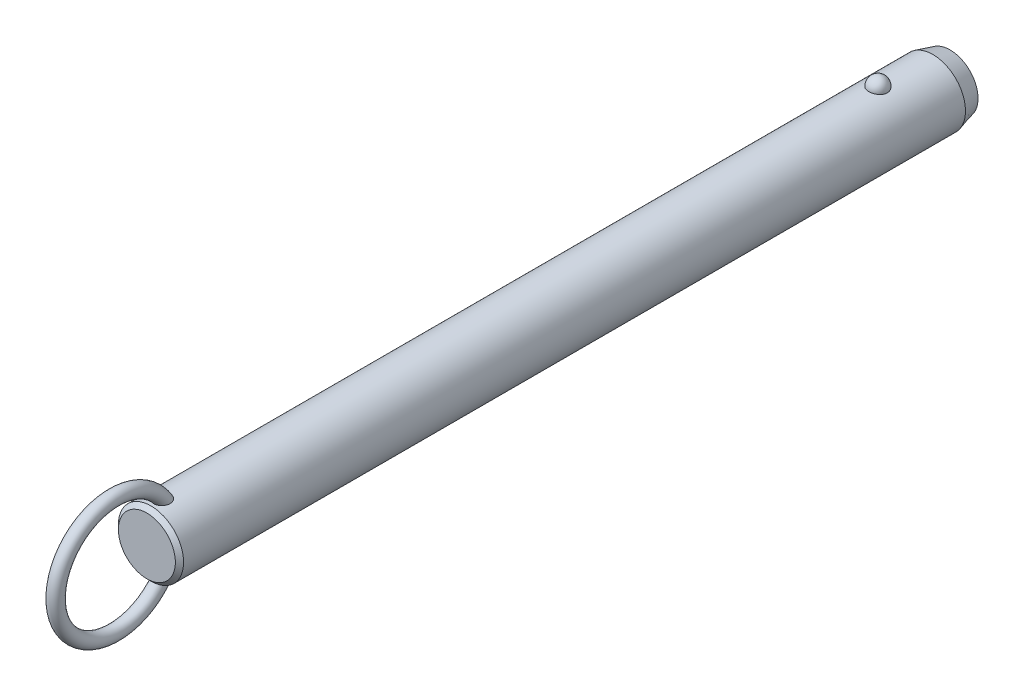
ISO-10303-21;
HEADER;
FILE_DESCRIPTION(('STEP AP214'),'2;1');
FILE_NAME('part.step','',(''),(''),'','','');
FILE_SCHEMA(('AUTOMOTIVE_DESIGN { 1 0 10303 214 1 1 1 1 }'));
ENDSEC;
DATA;
#1=APPLICATION_CONTEXT('core data for automotive mechanical design processes');
#2=APPLICATION_PROTOCOL_DEFINITION('international standard','automotive_design',2000,#1);
#3=PRODUCT_CONTEXT('',#1,'mechanical');
#4=PRODUCT('Part','Part','',(#3));
#5=PRODUCT_RELATED_PRODUCT_CATEGORY('part','',(#4));
#6=PRODUCT_DEFINITION_FORMATION('','',#4);
#7=PRODUCT_DEFINITION_CONTEXT('part definition',#1,'design');
#8=PRODUCT_DEFINITION('design','',#6,#7);
#9=PRODUCT_DEFINITION_SHAPE('','',#8);
#10=(LENGTH_UNIT() NAMED_UNIT(*) SI_UNIT(.MILLI.,.METRE.));
#11=(NAMED_UNIT(*) PLANE_ANGLE_UNIT() SI_UNIT($,.RADIAN.));
#12=(NAMED_UNIT(*) SI_UNIT($,.STERADIAN.) SOLID_ANGLE_UNIT());
#13=UNCERTAINTY_MEASURE_WITH_UNIT(LENGTH_MEASURE(1.E-05),#10,'distance_accuracy_value','');
#14=(GEOMETRIC_REPRESENTATION_CONTEXT(3) GLOBAL_UNCERTAINTY_ASSIGNED_CONTEXT((#13)) GLOBAL_UNIT_ASSIGNED_CONTEXT((#10,
#11,#12)) REPRESENTATION_CONTEXT('',''));
#15=CARTESIAN_POINT('',(0.,0.,0.));
#16=DIRECTION('',(0.,0.,1.));
#17=DIRECTION('',(1.,0.,0.));
#18=AXIS2_PLACEMENT_3D('',#15,#16,#17);
#19=CARTESIAN_POINT('',(0.,0.,200.7));
#20=DIRECTION('',(0.,0.,-1.));
#21=DIRECTION('',(-1.,0.,0.));
#22=AXIS2_PLACEMENT_3D('',#19,#20,#21);
#23=CYLINDRICAL_SURFACE('',#22,9.5);
#24=CARTESIAN_POINT('',(2.67259918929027,9.11631578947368,-2.70000000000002));
#25=CARTESIAN_POINT('',(2.6725968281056,9.11631786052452,-2.54909854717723));
#26=CARTESIAN_POINT('',(2.66030567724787,9.11994722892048,-2.39816735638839));
#27=CARTESIAN_POINT('',(2.6114347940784,9.13405924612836,-2.10058568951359));
#28=CARTESIAN_POINT('',(2.57484658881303,9.14454428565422,-1.95393672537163));
#29=CARTESIAN_POINT('',(2.47830875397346,9.17117631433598,-1.66916069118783));
#30=CARTESIAN_POINT('',(2.41836936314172,9.18732082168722,-1.53102991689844));
#31=CARTESIAN_POINT('',(2.27661331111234,9.22346780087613,-1.26705393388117));
#32=CARTESIAN_POINT('',(2.19479699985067,9.24347021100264,-1.14120852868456));
#33=CARTESIAN_POINT('',(2.01085282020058,9.28522401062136,-0.904632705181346));
#34=CARTESIAN_POINT('',(1.90862396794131,9.30698376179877,-0.793982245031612));
#35=CARTESIAN_POINT('',(1.6867437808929,9.34973971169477,-0.591607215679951));
#36=CARTESIAN_POINT('',(1.56709244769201,9.37073591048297,-0.499882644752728));
#37=CARTESIAN_POINT('',(1.31393976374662,9.40956370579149,-0.338167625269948));
#38=CARTESIAN_POINT('',(1.18048026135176,9.42740444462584,-0.268113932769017));
#39=CARTESIAN_POINT('',(0.903154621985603,9.45799906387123,-0.151390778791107));
#40=CARTESIAN_POINT('',(0.759289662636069,9.47075351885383,-0.104718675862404));
#41=CARTESIAN_POINT('',(0.468074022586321,9.48956256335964,-0.0367633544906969));
#42=CARTESIAN_POINT('',(0.320836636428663,9.49573643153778,-0.0150275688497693));
#43=CARTESIAN_POINT('',(0.0246714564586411,9.50112183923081,0.00396199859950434));
#44=CARTESIAN_POINT('',(-0.124256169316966,9.50033406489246,0.0012181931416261));
#45=CARTESIAN_POINT('',(-0.417264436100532,9.4919475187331,-0.0284441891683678));
#46=CARTESIAN_POINT('',(-0.56138413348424,9.48444885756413,-0.0550074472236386));
#47=CARTESIAN_POINT('',(-0.842986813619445,9.46357853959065,-0.131064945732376));
#48=CARTESIAN_POINT('',(-0.980469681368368,9.450206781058,-0.180559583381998));
#49=CARTESIAN_POINT('',(-1.24585005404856,9.41890822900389,-0.301476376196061));
#50=CARTESIAN_POINT('',(-1.37368611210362,9.40095498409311,-0.373026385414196));
#51=CARTESIAN_POINT('',(-1.61552738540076,9.36242964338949,-0.536025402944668));
#52=CARTESIAN_POINT('',(-1.72953116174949,9.34185727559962,-0.627476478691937));
#53=CARTESIAN_POINT('',(-1.9429225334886,9.29984568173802,-0.829844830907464));
#54=CARTESIAN_POINT('',(-2.04198021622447,9.27839736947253,-0.941108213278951));
#55=CARTESIAN_POINT('',(-2.2202646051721,9.23735994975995,-1.17883414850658));
#56=CARTESIAN_POINT('',(-2.29948985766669,9.21777097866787,-1.30529781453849));
#57=CARTESIAN_POINT('',(-2.43697287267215,9.18238994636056,-1.57158566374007));
#58=CARTESIAN_POINT('',(-2.49497068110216,9.16664569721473,-1.71155057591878));
#59=CARTESIAN_POINT('',(-2.5872073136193,9.14104303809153,-1.99961197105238));
#60=CARTESIAN_POINT('',(-2.62144683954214,9.13118445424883,-2.1477082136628));
#61=CARTESIAN_POINT('',(-2.66521466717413,9.11850622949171,-2.44715424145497));
#62=CARTESIAN_POINT('',(-2.67484831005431,9.11565658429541,-2.59848735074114));
#63=CARTESIAN_POINT('',(-2.66946735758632,9.11723375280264,-2.90067317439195));
#64=CARTESIAN_POINT('',(-2.65445345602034,9.12166036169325,-3.05152590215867));
#65=CARTESIAN_POINT('',(-2.60029711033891,9.13724422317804,-3.34766110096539));
#66=CARTESIAN_POINT('',(-2.56127978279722,9.14836656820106,-3.49296833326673));
#67=CARTESIAN_POINT('',(-2.46018844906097,9.17606676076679,-3.77477535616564));
#68=CARTESIAN_POINT('',(-2.39811349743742,9.1926448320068,-3.91127478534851));
#69=CARTESIAN_POINT('',(-2.25202303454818,9.22952198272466,-4.17244273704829));
#70=CARTESIAN_POINT('',(-2.16788714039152,9.24984129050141,-4.29704106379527));
#71=CARTESIAN_POINT('',(-1.97994083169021,9.29188255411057,-4.53013066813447));
#72=CARTESIAN_POINT('',(-1.87612963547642,9.31360456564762,-4.63862130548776));
#73=CARTESIAN_POINT('',(-1.65105429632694,9.35612959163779,-4.83690299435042));
#74=CARTESIAN_POINT('',(-1.52972405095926,9.37692871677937,-4.9266199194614));
#75=CARTESIAN_POINT('',(-1.27318250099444,9.41518970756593,-5.08429106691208));
#76=CARTESIAN_POINT('',(-1.13797219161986,9.432651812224,-5.15224684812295));
#77=CARTESIAN_POINT('',(-0.859280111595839,9.46208255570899,-5.26371827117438));
#78=CARTESIAN_POINT('',(-0.715925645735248,9.47411833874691,-5.30753421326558));
#79=CARTESIAN_POINT('',(-0.423550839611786,9.4916822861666,-5.37076321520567));
#80=CARTESIAN_POINT('',(-0.274531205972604,9.49721125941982,-5.39017930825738));
#81=CARTESIAN_POINT('',(0.0218446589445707,9.50110860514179,-5.40390587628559));
#82=CARTESIAN_POINT('',(0.169177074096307,9.49961381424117,-5.39869609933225));
#83=CARTESIAN_POINT('',(0.460808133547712,9.48993906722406,-5.36441955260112));
#84=CARTESIAN_POINT('',(0.605106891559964,9.48175936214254,-5.33535367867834));
#85=CARTESIAN_POINT('',(0.886027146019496,9.4596376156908,-5.25435587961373));
#86=CARTESIAN_POINT('',(1.02267710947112,9.44571881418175,-5.20251612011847));
#87=CARTESIAN_POINT('',(1.28523827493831,9.41358993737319,-5.07741549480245));
#88=CARTESIAN_POINT('',(1.41114877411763,9.39537958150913,-5.00415322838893));
#89=CARTESIAN_POINT('',(1.65085227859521,9.3562644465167,-4.83684599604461));
#90=CARTESIAN_POINT('',(1.76442346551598,9.33532178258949,-4.74249218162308));
#91=CARTESIAN_POINT('',(1.97425672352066,9.29321198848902,-4.53620389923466));
#92=CARTESIAN_POINT('',(2.07051582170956,9.27204482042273,-4.42426641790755));
#93=CARTESIAN_POINT('',(2.24490086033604,9.23139221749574,-4.18363183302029));
#94=CARTESIAN_POINT('',(2.32267019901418,9.21194380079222,-4.05466990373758));
#95=CARTESIAN_POINT('',(2.45584092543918,9.1773419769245,-3.78517836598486));
#96=CARTESIAN_POINT('',(2.5112497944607,9.16218713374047,-3.644652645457));
#97=CARTESIAN_POINT('',(2.59380876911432,9.13913522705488,-3.37104301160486));
#98=CARTESIAN_POINT('',(2.62330266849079,9.13064624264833,-3.23871053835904));
#99=CARTESIAN_POINT('',(2.66269870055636,9.11923566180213,-2.97092664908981));
#100=CARTESIAN_POINT('',(2.67260130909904,9.11631393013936,-2.83547530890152));
#101=CARTESIAN_POINT('',(2.67259918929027,9.11631578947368,-2.70000000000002));
#102=B_SPLINE_CURVE_WITH_KNOTS('',3,(#24,#25,#26,#27,#28,#29,#30,#31,#32,#33,#34,#35,#36,#37,
#38,#39,#40,#41,#42,#43,#44,#45,#46,#47,#48,#49,#50,#51,#52,#53,#54,#55,#56,#57,#58,#59,#60,#61,
#62,#63,#64,#65,#66,#67,#68,#69,#70,#71,#72,#73,#74,#75,#76,#77,#78,#79,#80,#81,#82,#83,#84,#85,
#86,#87,#88,#89,#90,#91,#92,#93,#94,#95,#96,#97,#98,#99,#100,#101),.UNSPECIFIED.,.T.,.F.,(4,2,2,
2,2,2,2,2,2,2,2,2,2,2,2,2,2,2,2,2,2,2,2,2,2,2,2,2,2,2,2,2,2,2,2,2,2,2,4),(0.,0.452217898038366,
0.904593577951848,1.35677112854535,1.80894144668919,2.26340676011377,2.71787203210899,
3.17099820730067,3.62407318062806,4.06878835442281,4.51345969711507,4.95160616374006,
5.38976021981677,5.83050358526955,6.27129275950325,6.72071308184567,7.17016633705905,
7.62495278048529,8.07972578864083,8.53254856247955,8.98535859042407,9.43582813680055,
9.88631615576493,10.3393155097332,10.7923328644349,11.2471065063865,11.7018475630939,
12.150795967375,12.599688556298,13.0398725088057,13.4800399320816,13.9184421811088,
14.3568730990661,14.802202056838,15.2476074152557,15.7010097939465,16.1542603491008,
16.5602594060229,16.9662486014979),.UNSPECIFIED.);
#103=CARTESIAN_POINT('',(2.67259918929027,9.11631578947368,-2.70000000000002));
#104=VERTEX_POINT('',#103);
#105=EDGE_CURVE('E41',#104,#104,#102,.T.);
#106=ORIENTED_EDGE('',*,*,#105,.T.);
#107=EDGE_LOOP('',(#106));
#108=FACE_BOUND('',#107,.T.);
#109=CARTESIAN_POINT('',(0.,0.,209.02));
#110=DIRECTION('',(0.,0.,1.));
#111=DIRECTION('',(1.,0.,0.));
#112=AXIS2_PLACEMENT_3D('',#109,#110,#111);
#113=CIRCLE('',#112,9.5);
#114=CARTESIAN_POINT('',(-9.50000000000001,0.,209.02));
#115=VERTEX_POINT('',#114);
#116=EDGE_CURVE('E10',#115,#115,#113,.F.);
#117=ORIENTED_EDGE('',*,*,#116,.T.);
#118=EDGE_LOOP('',(#117));
#119=FACE_BOUND('',#118,.T.);
#120=CARTESIAN_POINT('',(-0.697062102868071,-9.47439269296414,203.367808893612));
#121=CARTESIAN_POINT('',(-0.799579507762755,-9.46685146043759,203.407482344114));
#122=CARTESIAN_POINT('',(-0.898575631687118,-9.45788043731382,203.4559309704));
#123=CARTESIAN_POINT('',(-1.08670047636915,-9.43811593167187,203.568868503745));
#124=CARTESIAN_POINT('',(-1.17583204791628,-9.42732297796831,203.633352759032));
#125=CARTESIAN_POINT('',(-1.34179806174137,-9.40513672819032,203.776209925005));
#126=CARTESIAN_POINT('',(-1.41865133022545,-9.39374438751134,203.854561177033));
#127=CARTESIAN_POINT('',(-1.5586004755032,-9.37154196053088,204.022752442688));
#128=CARTESIAN_POINT('',(-1.62169476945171,-9.3607319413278,204.11259377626));
#129=CARTESIAN_POINT('',(-1.73527695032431,-9.34035749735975,204.304500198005));
#130=CARTESIAN_POINT('',(-1.78522266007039,-9.33085270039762,204.406891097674));
#131=CARTESIAN_POINT('',(-1.86924997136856,-9.3143834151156,204.618148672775));
#132=CARTESIAN_POINT('',(-1.90332570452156,-9.30741986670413,204.727017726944));
#133=CARTESIAN_POINT('',(-1.95893603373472,-9.29588482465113,204.960473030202));
#134=CARTESIAN_POINT('',(-1.97872420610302,-9.29165182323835,205.085489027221));
#135=CARTESIAN_POINT('',(-2.00062129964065,-9.28695978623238,205.337080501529));
#136=CARTESIAN_POINT('',(-2.00272284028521,-9.28650232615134,205.463656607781));
#137=CARTESIAN_POINT('',(-1.98958876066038,-9.28932750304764,205.736815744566));
#138=CARTESIAN_POINT('',(-1.97143366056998,-9.2932400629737,205.883251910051));
#139=CARTESIAN_POINT('',(-1.91479925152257,-9.30507151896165,206.172062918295));
#140=CARTESIAN_POINT('',(-1.87629122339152,-9.31299607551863,206.314431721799));
#141=CARTESIAN_POINT('',(-1.77225683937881,-9.33340232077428,206.615172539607));
#142=CARTESIAN_POINT('',(-1.70334898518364,-9.34641636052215,206.772369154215));
#143=CARTESIAN_POINT('',(-1.58111062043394,-9.36759153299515,206.997517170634));
#144=CARTESIAN_POINT('',(-1.53721459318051,-9.37492619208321,207.070796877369));
#145=CARTESIAN_POINT('',(-1.44302631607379,-9.38988566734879,207.21307405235));
#146=CARTESIAN_POINT('',(-1.39273721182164,-9.39751033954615,207.282073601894));
#147=CARTESIAN_POINT('',(-1.26775962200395,-9.41530678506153,207.436983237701));
#148=CARTESIAN_POINT('',(-1.19052326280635,-9.42548108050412,207.520871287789));
#149=CARTESIAN_POINT('',(-1.02420241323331,-9.44499825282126,207.676008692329));
#150=CARTESIAN_POINT('',(-0.935139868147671,-9.45434261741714,207.747280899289));
#151=CARTESIAN_POINT('',(-0.766610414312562,-9.46930670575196,207.858695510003));
#152=CARTESIAN_POINT('',(-0.689439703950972,-9.47529223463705,207.902235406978));
#153=CARTESIAN_POINT('',(-0.528942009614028,-9.48560294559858,207.97631336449));
#154=CARTESIAN_POINT('',(-0.445620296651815,-9.48992953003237,208.006862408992));
#155=CARTESIAN_POINT('',(-0.273901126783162,-9.49644161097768,208.052579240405));
#156=CARTESIAN_POINT('',(-0.18546574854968,-9.49860811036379,208.06761059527));
#157=CARTESIAN_POINT('',(-0.00734541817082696,-9.5004135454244,208.080149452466));
#158=CARTESIAN_POINT('',(0.0823387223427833,-9.50005405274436,208.077667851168));
#159=CARTESIAN_POINT('',(0.247679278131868,-9.49708301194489,208.056995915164));
#160=CARTESIAN_POINT('',(0.32362017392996,-9.49477609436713,208.040930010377));
#161=CARTESIAN_POINT('',(0.471981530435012,-9.48855917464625,207.997172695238));
#162=CARTESIAN_POINT('',(0.544400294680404,-9.48464840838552,207.969475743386));
#163=CARTESIAN_POINT('',(0.708947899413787,-9.47398336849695,207.89280266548));
#164=CARTESIAN_POINT('',(0.799149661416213,-9.46671310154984,207.839774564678));
#165=CARTESIAN_POINT('',(0.969783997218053,-9.45076225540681,207.719973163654));
#166=CARTESIAN_POINT('',(1.050194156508,-9.44207854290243,207.653169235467));
#167=CARTESIAN_POINT('',(1.23092343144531,-9.42051459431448,207.480759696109));
#168=CARTESIAN_POINT('',(1.32652499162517,-9.40733378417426,207.37026193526));
#169=CARTESIAN_POINT('',(1.49893121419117,-9.38140745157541,207.135561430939));
#170=CARTESIAN_POINT('',(1.57571616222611,-9.36866239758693,207.011344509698));
#171=CARTESIAN_POINT('',(1.71285426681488,-9.34457644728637,206.749389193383));
#172=CARTESIAN_POINT('',(1.77266365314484,-9.33328726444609,206.61136233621));
#173=CARTESIAN_POINT('',(1.87239208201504,-9.31379209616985,206.328051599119));
#174=CARTESIAN_POINT('',(1.91230158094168,-9.3055875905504,206.182764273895));
#175=CARTESIAN_POINT('',(1.97604189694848,-9.29228394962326,205.862028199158));
#176=CARTESIAN_POINT('',(1.9958743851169,-9.28797202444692,205.685724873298));
#177=CARTESIAN_POINT('',(2.0029570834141,-9.28645519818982,205.332414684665));
#178=CARTESIAN_POINT('',(1.99025930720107,-9.28923895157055,205.155409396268));
#179=CARTESIAN_POINT('',(1.93735479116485,-9.30038134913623,204.856338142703));
#180=CARTESIAN_POINT('',(1.90576827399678,-9.30697680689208,204.732667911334));
#181=CARTESIAN_POINT('',(1.8228748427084,-9.32356855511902,204.492329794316));
#182=CARTESIAN_POINT('',(1.77158213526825,-9.33356239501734,204.375656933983));
#183=CARTESIAN_POINT('',(1.64885744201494,-9.35602275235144,204.152706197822));
#184=CARTESIAN_POINT('',(1.57730995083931,-9.36850332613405,204.046492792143));
#185=CARTESIAN_POINT('',(1.41543264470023,-9.39431873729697,203.849553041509));
#186=CARTESIAN_POINT('',(1.32510883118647,-9.40765330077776,203.758821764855));
#187=CARTESIAN_POINT('',(1.13846223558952,-9.43195720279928,203.605033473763));
#188=CARTESIAN_POINT('',(1.04369890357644,-9.44302894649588,203.540094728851));
#189=CARTESIAN_POINT('',(0.843965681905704,-9.46296805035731,203.428038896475));
#190=CARTESIAN_POINT('',(0.739000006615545,-9.47183631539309,203.380914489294));
#191=CARTESIAN_POINT('',(0.528175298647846,-9.48586140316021,203.308117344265));
#192=CARTESIAN_POINT('',(0.422686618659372,-9.49119633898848,203.28140249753));
#193=CARTESIAN_POINT('',(0.208590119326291,-9.49831365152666,203.246013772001));
#194=CARTESIAN_POINT('',(0.0999817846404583,-9.500095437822,203.237342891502));
#195=CARTESIAN_POINT('',(-0.126104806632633,-9.49988861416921,203.238350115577));
#196=CARTESIAN_POINT('',(-0.243578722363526,-9.49757821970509,203.249594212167));
#197=CARTESIAN_POINT('',(-0.474390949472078,-9.48885165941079,203.293167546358));
#198=CARTESIAN_POINT('',(-0.587729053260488,-9.48243528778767,203.325497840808));
#199=CARTESIAN_POINT('',(-0.697062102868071,-9.47439269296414,203.367808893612));
#200=B_SPLINE_CURVE_WITH_KNOTS('',3,(#120,#121,#122,#123,#124,#125,#126,#127,#128,#129,#130,
#131,#132,#133,#134,#135,#136,#137,#138,#139,#140,#141,#142,#143,#144,#145,#146,#147,#148,#149,
#150,#151,#152,#153,#154,#155,#156,#157,#158,#159,#160,#161,#162,#163,#164,#165,#166,#167,#168,
#169,#170,#171,#172,#173,#174,#175,#176,#177,#178,#179,#180,#181,#182,#183,#184,#185,#186,#187,
#188,#189,#190,#191,#192,#193,#194,#195,#196,#197,#198,#199),.UNSPECIFIED.,.T.,.F.,(4,2,2,2,2,2,
2,2,2,2,2,2,2,2,2,2,2,2,2,2,2,2,2,2,2,2,2,2,2,2,2,2,2,2,2,2,2,2,2,4),(0.,0.330119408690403,
0.660143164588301,0.989655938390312,1.31920659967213,1.66074728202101,2.00241415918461,
2.38088696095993,2.75951768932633,3.20065679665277,3.64242004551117,4.15620996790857,
4.41314162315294,4.66994734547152,5.01228664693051,5.35399933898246,5.61943037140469,
5.88463652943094,6.15215502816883,6.4195070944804,6.65144391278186,6.88349136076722,
7.19641200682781,7.51003602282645,7.94779711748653,8.3860149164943,8.83699707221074,
9.28819530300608,9.81778662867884,10.34653170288,10.7284172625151,11.1100280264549,
11.4938603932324,11.8775702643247,12.2220189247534,12.5663259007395,12.8915939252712,
13.2169159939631,13.5689650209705,13.9210316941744),.UNSPECIFIED.);
#201=CARTESIAN_POINT('',(-0.697062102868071,-9.47439269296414,203.367808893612));
#202=VERTEX_POINT('',#201);
#203=EDGE_CURVE('E60',#202,#202,#200,.T.);
#204=ORIENTED_EDGE('',*,*,#203,.T.);
#205=EDGE_LOOP('',(#204));
#206=FACE_BOUND('',#205,.T.);
#207=CARTESIAN_POINT('',(-0.697062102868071,9.47439269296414,203.367808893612));
#208=CARTESIAN_POINT('',(-0.597792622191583,9.48169483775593,203.329395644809));
#209=CARTESIAN_POINT('',(-0.495106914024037,9.48766580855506,203.299168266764));
#210=CARTESIAN_POINT('',(-0.285876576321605,9.49627648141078,203.256032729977));
#211=CARTESIAN_POINT('',(-0.179324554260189,9.49890941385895,203.243159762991));
#212=CARTESIAN_POINT('',(0.0344157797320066,9.50053798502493,203.235166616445));
#213=CARTESIAN_POINT('',(0.141603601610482,9.49953613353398,203.240034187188));
#214=CARTESIAN_POINT('',(0.35356357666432,9.49401038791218,203.267365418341));
#215=CARTESIAN_POINT('',(0.458336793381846,9.48948807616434,203.28982117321));
#216=CARTESIAN_POINT('',(0.662493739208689,9.4774236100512,203.351671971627));
#217=CARTESIAN_POINT('',(0.761881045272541,9.46988348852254,203.391055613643));
#218=CARTESIAN_POINT('',(0.95260839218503,9.45260382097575,203.485634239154));
#219=CARTESIAN_POINT('',(1.04394806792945,9.44286417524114,203.540829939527));
#220=CARTESIAN_POINT('',(1.21712767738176,9.42211760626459,203.666066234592));
#221=CARTESIAN_POINT('',(1.29885671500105,9.41109835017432,203.736257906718));
#222=CARTESIAN_POINT('',(1.44978975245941,9.38903310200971,203.888980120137));
#223=CARTESIAN_POINT('',(1.51899278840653,9.37798710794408,203.971511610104));
#224=CARTESIAN_POINT('',(1.64602857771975,9.35654375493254,204.149776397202));
#225=CARTESIAN_POINT('',(1.70333052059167,9.34618688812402,204.245891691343));
#226=CARTESIAN_POINT('',(1.80259341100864,9.32755128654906,204.445897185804));
#227=CARTESIAN_POINT('',(1.84454942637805,9.31927322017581,204.549789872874));
#228=CARTESIAN_POINT('',(1.91637039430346,9.30478365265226,204.772213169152));
#229=CARTESIAN_POINT('',(1.944805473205,9.29882552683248,204.891219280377));
#230=CARTESIAN_POINT('',(1.98449865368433,9.29043398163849,205.132143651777));
#231=CARTESIAN_POINT('',(1.99574908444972,9.28800213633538,205.254063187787));
#232=CARTESIAN_POINT('',(2.00275141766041,9.28649645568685,205.516932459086));
#233=CARTESIAN_POINT('',(1.99588238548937,9.28799035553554,205.657952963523));
#234=CARTESIAN_POINT('',(1.96270559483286,9.29505517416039,205.937621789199));
#235=CARTESIAN_POINT('',(1.93637872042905,9.30063010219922,206.076267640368));
#236=CARTESIAN_POINT('',(1.85949176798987,9.31633564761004,206.372561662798));
#237=CARTESIAN_POINT('',(1.80549792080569,9.3270926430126,206.529290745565));
#238=CARTESIAN_POINT('',(1.67376869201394,9.3516306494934,206.832284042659));
#239=CARTESIAN_POINT('',(1.59603181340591,9.36541185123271,206.978547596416));
#240=CARTESIAN_POINT('',(1.4360277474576,9.39110706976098,207.225813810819));
#241=CARTESIAN_POINT('',(1.35831795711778,9.40278656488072,207.329791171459));
#242=CARTESIAN_POINT('',(1.18774483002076,9.42585025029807,207.524534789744));
#243=CARTESIAN_POINT('',(1.09490932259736,9.43723493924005,207.615324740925));
#244=CARTESIAN_POINT('',(0.921110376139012,9.45552616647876,207.75620334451));
#245=CARTESIAN_POINT('',(0.84373824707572,9.46281058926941,207.810656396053));
#246=CARTESIAN_POINT('',(0.681245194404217,9.47589120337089,207.906711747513));
#247=CARTESIAN_POINT('',(0.596135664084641,9.48168953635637,207.948332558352));
#248=CARTESIAN_POINT('',(0.433779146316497,9.49038144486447,208.010089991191));
#249=CARTESIAN_POINT('',(0.357459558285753,9.49359170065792,208.03260136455));
#250=CARTESIAN_POINT('',(0.202074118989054,9.49816761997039,208.064574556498));
#251=CARTESIAN_POINT('',(0.123010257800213,9.49953459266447,208.074045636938));
#252=CARTESIAN_POINT('',(-0.0357372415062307,9.50026497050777,208.079114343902));
#253=CARTESIAN_POINT('',(-0.115421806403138,9.49962433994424,208.074684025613));
#254=CARTESIAN_POINT('',(-0.272823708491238,9.49640854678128,208.052296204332));
#255=CARTESIAN_POINT('',(-0.350540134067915,9.4938325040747,208.034332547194));
#256=CARTESIAN_POINT('',(-0.500580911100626,9.48709462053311,207.986802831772));
#257=CARTESIAN_POINT('',(-0.572979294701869,9.48296359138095,207.957461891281));
#258=CARTESIAN_POINT('',(-0.712864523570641,9.47347609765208,207.889008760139));
#259=CARTESIAN_POINT('',(-0.780349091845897,9.46811906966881,207.849892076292));
#260=CARTESIAN_POINT('',(-0.946309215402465,9.45329720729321,207.739432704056));
#261=CARTESIAN_POINT('',(-1.04090230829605,9.44321512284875,207.662329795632));
#262=CARTESIAN_POINT('',(-1.21661929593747,9.42219227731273,207.49409718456));
#263=CARTESIAN_POINT('',(-1.29770519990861,9.41124921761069,207.402929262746));
#264=CARTESIAN_POINT('',(-1.47319646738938,9.38563439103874,207.176162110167));
#265=CARTESIAN_POINT('',(-1.56208878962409,9.37102009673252,207.036289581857));
#266=CARTESIAN_POINT('',(-1.71623987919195,9.34401559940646,206.743950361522));
#267=CARTESIAN_POINT('',(-1.78147866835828,9.33162728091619,206.591473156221));
#268=CARTESIAN_POINT('',(-1.88853837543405,9.31055541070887,206.275647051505));
#269=CARTESIAN_POINT('',(-1.92998995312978,9.30193076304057,206.112168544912));
#270=CARTESIAN_POINT('',(-1.98590726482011,9.29015757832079,205.780526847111));
#271=CARTESIAN_POINT('',(-2.0004070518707,9.2870021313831,205.612369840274));
#272=CARTESIAN_POINT('',(-1.99964701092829,9.28716218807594,205.305080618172));
#273=CARTESIAN_POINT('',(-1.98908145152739,9.28945704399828,205.165936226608));
#274=CARTESIAN_POINT('',(-1.94566294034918,9.29865169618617,204.891153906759));
#275=CARTESIAN_POINT('',(-1.9128206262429,9.30554929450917,204.755514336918));
#276=CARTESIAN_POINT('',(-1.84582133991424,9.31898248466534,204.557802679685));
#277=CARTESIAN_POINT('',(-1.82038084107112,9.32400364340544,204.492583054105));
#278=CARTESIAN_POINT('',(-1.76350511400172,9.33492884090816,204.364903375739));
#279=CARTESIAN_POINT('',(-1.73207305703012,9.34083241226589,204.302441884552));
#280=CARTESIAN_POINT('',(-1.66324243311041,9.35333332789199,204.18094078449));
#281=CARTESIAN_POINT('',(-1.62584239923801,9.35993084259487,204.121902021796));
#282=CARTESIAN_POINT('',(-1.54527678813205,9.37356864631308,204.007987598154));
#283=CARTESIAN_POINT('',(-1.50211241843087,9.38060884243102,203.953111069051));
#284=CARTESIAN_POINT('',(-1.37681147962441,9.40004442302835,203.809961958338));
#285=CARTESIAN_POINT('',(-1.28916358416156,9.41261047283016,203.726429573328));
#286=CARTESIAN_POINT('',(-1.09996826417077,9.43658180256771,203.577236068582));
#287=CARTESIAN_POINT('',(-0.998461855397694,9.44799034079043,203.511523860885));
#288=CARTESIAN_POINT('',(-0.860188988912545,9.46103017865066,203.4394367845));
#289=CARTESIAN_POINT('',(-0.828141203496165,9.46389141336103,203.423851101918));
#290=CARTESIAN_POINT('',(-0.763210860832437,9.46934915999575,203.394473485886));
#291=CARTESIAN_POINT('',(-0.730328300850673,9.47194567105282,203.380681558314));
#292=CARTESIAN_POINT('',(-0.697062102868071,9.47439269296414,203.367808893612));
#293=B_SPLINE_CURVE_WITH_KNOTS('',3,(#207,#208,#209,#210,#211,#212,#213,#214,#215,#216,#217,
#218,#219,#220,#221,#222,#223,#224,#225,#226,#227,#228,#229,#230,#231,#232,#233,#234,#235,#236,
#237,#238,#239,#240,#241,#242,#243,#244,#245,#246,#247,#248,#249,#250,#251,#252,#253,#254,#255,
#256,#257,#258,#259,#260,#261,#262,#263,#264,#265,#266,#267,#268,#269,#270,#271,#272,#273,#274,
#275,#276,#277,#278,#279,#280,#281,#282,#283,#284,#285,#286,#287,#288,#289,#290,#291,#292),
.UNSPECIFIED.,.T.,.F.,(4,2,2,2,2,2,2,2,2,2,2,2,2,2,2,2,2,2,2,2,2,2,2,2,2,2,2,2,2,2,2,2,2,2,2,2,
2,2,2,2,2,2,4),(0.,0.319942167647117,0.640532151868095,0.96090081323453,1.2811255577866,
1.60113495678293,1.92115886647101,2.24457323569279,2.56801248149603,2.90371927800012,
3.23953387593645,3.60560313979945,3.97183576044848,4.39383693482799,4.8162532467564,
5.31257045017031,5.80891895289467,6.19868344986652,6.58773876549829,6.87145417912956,
7.15475838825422,7.39263751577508,7.63034760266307,7.86853584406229,8.10683246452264,
8.3406366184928,8.57454843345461,8.93983939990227,9.30614105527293,9.80266668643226,
10.2996107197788,10.8040753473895,11.3079021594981,11.7249776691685,12.1418541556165,
12.3521485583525,12.5623319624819,12.7725671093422,12.9827582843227,13.345827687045,
13.7078449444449,13.8150604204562,13.9222762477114),.UNSPECIFIED.);
#294=CARTESIAN_POINT('',(-0.697062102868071,9.47439269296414,203.367808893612));
#295=VERTEX_POINT('',#294);
#296=EDGE_CURVE('E68',#295,#295,#293,.T.);
#297=ORIENTED_EDGE('',*,*,#296,.T.);
#298=EDGE_LOOP('',(#297));
#299=FACE_BOUND('',#298,.T.);
#300=CARTESIAN_POINT('',(0.,0.,-18.7000000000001));
#301=DIRECTION('',(0.,0.,-1.));
#302=DIRECTION('',(-1.,0.,0.));
#303=AXIS2_PLACEMENT_3D('',#300,#301,#302);
#304=CIRCLE('',#303,9.5);
#305=CARTESIAN_POINT('',(-9.5,0.,-18.7000000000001));
#306=VERTEX_POINT('',#305);
#307=EDGE_CURVE('E57',#306,#306,#304,.F.);
#308=ORIENTED_EDGE('',*,*,#307,.T.);
#309=EDGE_LOOP('',(#308));
#310=FACE_BOUND('',#309,.T.);
#311=ADVANCED_FACE('F37',(#108,#119,#206,#299,#310),#23,.T.);
#312=CARTESIAN_POINT('',(0.,0.,-23.7));
#313=DIRECTION('',(0.,0.,-1.));
#314=DIRECTION('',(-1.,0.,0.));
#315=AXIS2_PLACEMENT_3D('',#312,#313,#314);
#316=PLANE('',#315);
#317=CARTESIAN_POINT('',(0.,0.,-23.7));
#318=DIRECTION('',(0.,0.,-1.));
#319=DIRECTION('',(-1.,0.,0.));
#320=AXIS2_PLACEMENT_3D('',#317,#318,#319);
#321=CIRCLE('',#320,8.1602540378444);
#322=CARTESIAN_POINT('',(-8.1602540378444,0.,-23.7));
#323=VERTEX_POINT('',#322);
#324=EDGE_CURVE('E67',#323,#323,#321,.T.);
#325=ORIENTED_EDGE('',*,*,#324,.T.);
#326=EDGE_LOOP('',(#325));
#327=FACE_BOUND('',#326,.T.);
#328=ADVANCED_FACE('F86',(#327),#316,.T.);
#329=CARTESIAN_POINT('',(0.,0.,-23.7));
#330=DIRECTION('',(0.,0.,1.));
#331=DIRECTION('',(1.,0.,0.));
#332=AXIS2_PLACEMENT_3D('',#329,#330,#331);
#333=CONICAL_SURFACE('',#332,8.1602540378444,0.261799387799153);
#334=ORIENTED_EDGE('',*,*,#307,.F.);
#335=EDGE_LOOP('',(#334));
#336=FACE_BOUND('',#335,.T.);
#337=ORIENTED_EDGE('',*,*,#324,.F.);
#338=EDGE_LOOP('',(#337));
#339=FACE_BOUND('',#338,.T.);
#340=ADVANCED_FACE('F84',(#336,#339),#333,.T.);
#341=CARTESIAN_POINT('',(0.,0.,210.22));
#342=DIRECTION('',(0.,0.,1.));
#343=DIRECTION('',(1.,0.,0.));
#344=AXIS2_PLACEMENT_3D('',#341,#342,#343);
#345=PLANE('',#344);
#346=CARTESIAN_POINT('',(0.,0.,210.22));
#347=DIRECTION('',(0.,0.,1.));
#348=DIRECTION('',(1.,0.,0.));
#349=AXIS2_PLACEMENT_3D('',#346,#347,#348);
#350=CIRCLE('',#349,8.30000000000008);
#351=CARTESIAN_POINT('',(-8.3000000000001,0.,210.22));
#352=VERTEX_POINT('',#351);
#353=EDGE_CURVE('E50',#352,#352,#350,.T.);
#354=ORIENTED_EDGE('',*,*,#353,.T.);
#355=EDGE_LOOP('',(#354));
#356=FACE_BOUND('',#355,.T.);
#357=ADVANCED_FACE('F78',(#356),#345,.T.);
#358=CARTESIAN_POINT('',(0.,0.,219.75));
#359=DIRECTION('',(1.,0.,0.));
#360=DIRECTION('',(0.,0.,-1.));
#361=AXIS2_PLACEMENT_3D('',#358,#359,#360);
#362=TOROIDAL_SURFACE('',#361,17.05,2.);
#363=ORIENTED_EDGE('',*,*,#296,.F.);
#364=EDGE_LOOP('',(#363));
#365=FACE_BOUND('',#364,.T.);
#366=ORIENTED_EDGE('',*,*,#203,.F.);
#367=EDGE_LOOP('',(#366));
#368=FACE_BOUND('',#367,.T.);
#369=ADVANCED_FACE('F74',(#365,#368),#362,.T.);
#370=CARTESIAN_POINT('',(0.,0.,210.22));
#371=DIRECTION('',(0.,0.,-1.));
#372=DIRECTION('',(-1.,0.,0.));
#373=AXIS2_PLACEMENT_3D('',#370,#371,#372);
#374=CONICAL_SURFACE('',#373,8.30000000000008,0.785398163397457);
#375=CARTESIAN_POINT('',(-9.50000000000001,0.,209.02));
#376=CARTESIAN_POINT('',(-9.48750000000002,0.,209.0325));
#377=CARTESIAN_POINT('',(-9.47500000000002,0.,209.045));
#378=CARTESIAN_POINT('',(-9.45000000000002,0.,209.07));
#379=CARTESIAN_POINT('',(-9.43750000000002,0.,209.0825));
#380=CARTESIAN_POINT('',(-9.41250000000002,0.,209.1075));
#381=CARTESIAN_POINT('',(-9.40000000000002,0.,209.12));
#382=CARTESIAN_POINT('',(-9.37500000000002,0.,209.145));
#383=CARTESIAN_POINT('',(-9.36250000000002,0.,209.1575));
#384=CARTESIAN_POINT('',(-9.33750000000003,0.,209.1825));
#385=CARTESIAN_POINT('',(-9.32500000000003,0.,209.195));
#386=CARTESIAN_POINT('',(-9.30000000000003,0.,209.22));
#387=CARTESIAN_POINT('',(-9.28750000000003,0.,209.2325));
#388=CARTESIAN_POINT('',(-9.26250000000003,0.,209.2575));
#389=CARTESIAN_POINT('',(-9.25000000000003,0.,209.27));
#390=CARTESIAN_POINT('',(-9.22500000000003,0.,209.295));
#391=CARTESIAN_POINT('',(-9.21250000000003,0.,209.3075));
#392=CARTESIAN_POINT('',(-9.18750000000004,0.,209.3325));
#393=CARTESIAN_POINT('',(-9.17500000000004,0.,209.345));
#394=CARTESIAN_POINT('',(-9.15000000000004,0.,209.37));
#395=CARTESIAN_POINT('',(-9.13750000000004,0.,209.3825));
#396=CARTESIAN_POINT('',(-9.11250000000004,0.,209.4075));
#397=CARTESIAN_POINT('',(-9.10000000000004,0.,209.42));
#398=CARTESIAN_POINT('',(-9.07500000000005,0.,209.445));
#399=CARTESIAN_POINT('',(-9.06250000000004,0.,209.4575));
#400=CARTESIAN_POINT('',(-9.03750000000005,0.,209.4825));
#401=CARTESIAN_POINT('',(-9.02500000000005,0.,209.495));
#402=CARTESIAN_POINT('',(-9.00000000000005,0.,209.52));
#403=CARTESIAN_POINT('',(-8.98750000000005,0.,209.5325));
#404=CARTESIAN_POINT('',(-8.96250000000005,0.,209.5575));
#405=CARTESIAN_POINT('',(-8.95000000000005,0.,209.57));
#406=CARTESIAN_POINT('',(-8.92500000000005,0.,209.595));
#407=CARTESIAN_POINT('',(-8.91250000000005,0.,209.6075));
#408=CARTESIAN_POINT('',(-8.88750000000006,0.,209.6325));
#409=CARTESIAN_POINT('',(-8.87500000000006,0.,209.645));
#410=CARTESIAN_POINT('',(-8.85000000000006,0.,209.67));
#411=CARTESIAN_POINT('',(-8.83750000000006,0.,209.6825));
#412=CARTESIAN_POINT('',(-8.81250000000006,0.,209.7075));
#413=CARTESIAN_POINT('',(-8.80000000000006,0.,209.72));
#414=CARTESIAN_POINT('',(-8.77500000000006,0.,209.745));
#415=CARTESIAN_POINT('',(-8.76250000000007,0.,209.7575));
#416=CARTESIAN_POINT('',(-8.73750000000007,0.,209.7825));
#417=CARTESIAN_POINT('',(-8.72500000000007,0.,209.795));
#418=CARTESIAN_POINT('',(-8.70000000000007,0.,209.82));
#419=CARTESIAN_POINT('',(-8.68750000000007,0.,209.8325));
#420=CARTESIAN_POINT('',(-8.66250000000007,0.,209.8575));
#421=CARTESIAN_POINT('',(-8.65000000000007,0.,209.87));
#422=CARTESIAN_POINT('',(-8.62500000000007,0.,209.895));
#423=CARTESIAN_POINT('',(-8.61250000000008,0.,209.9075));
#424=CARTESIAN_POINT('',(-8.58750000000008,0.,209.9325));
#425=CARTESIAN_POINT('',(-8.57500000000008,0.,209.945));
#426=CARTESIAN_POINT('',(-8.55000000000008,0.,209.97));
#427=CARTESIAN_POINT('',(-8.53750000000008,0.,209.9825));
#428=CARTESIAN_POINT('',(-8.51250000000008,0.,210.0075));
#429=CARTESIAN_POINT('',(-8.50000000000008,0.,210.02));
#430=CARTESIAN_POINT('',(-8.47500000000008,0.,210.045));
#431=CARTESIAN_POINT('',(-8.46250000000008,0.,210.0575));
#432=CARTESIAN_POINT('',(-8.43750000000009,0.,210.0825));
#433=CARTESIAN_POINT('',(-8.42500000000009,0.,210.095));
#434=CARTESIAN_POINT('',(-8.40000000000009,0.,210.12));
#435=CARTESIAN_POINT('',(-8.38750000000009,0.,210.1325));
#436=CARTESIAN_POINT('',(-8.36250000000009,0.,210.1575));
#437=CARTESIAN_POINT('',(-8.35000000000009,0.,210.17));
#438=CARTESIAN_POINT('',(-8.32500000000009,0.,210.195));
#439=CARTESIAN_POINT('',(-8.31250000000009,0.,210.2075));
#440=CARTESIAN_POINT('',(-8.3000000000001,0.,210.22));
#441=B_SPLINE_CURVE_WITH_KNOTS('',3,(#375,#376,#377,#378,#379,#380,#381,#382,#383,#384,#385,
#386,#387,#388,#389,#390,#391,#392,#393,#394,#395,#396,#397,#398,#399,#400,#401,#402,#403,#404,
#405,#406,#407,#408,#409,#410,#411,#412,#413,#414,#415,#416,#417,#418,#419,#420,#421,#422,#423,
#424,#425,#426,#427,#428,#429,#430,#431,#432,#433,#434,#435,#436,#437,#438,#439,#440),
.UNSPECIFIED.,.F.,.F.,(4,2,2,2,2,2,2,2,2,2,2,2,2,2,2,2,2,2,2,2,2,2,2,2,2,2,2,2,2,2,2,2,4),(0.,
0.0530330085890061,0.106066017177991,0.159099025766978,0.212132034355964,0.265165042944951,
0.318198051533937,0.371231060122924,0.42426406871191,0.477297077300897,0.530330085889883,
0.583363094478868,0.636396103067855,0.689429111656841,0.742462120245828,0.795495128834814,
0.848528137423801,0.901561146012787,0.954594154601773,1.00762716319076,1.06066017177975,
1.11369318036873,1.16672618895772,1.2197591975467,1.27279220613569,1.32582521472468,
1.37885822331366,1.43189123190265,1.48492424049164,1.53795724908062,1.59099025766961,
1.64402326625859,1.6970562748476),.UNSPECIFIED.);
#442=EDGE_CURVE('BSEAM39',#115,#352,#441,.T.);
#443=ORIENTED_EDGE('',*,*,#116,.F.);
#444=ORIENTED_EDGE('',*,*,#353,.F.);
#445=ORIENTED_EDGE('',*,*,#442,.T.);
#446=ORIENTED_EDGE('',*,*,#442,.F.);
#447=EDGE_LOOP('',(#443,#445,#444,#446));
#448=FACE_BOUND('',#447,.T.);
#449=ADVANCED_FACE('F39',(#448),#374,.T.);
#450=CARTESIAN_POINT('',(0.,9.5,-2.70000000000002));
#451=DIRECTION('',(0.,1.,0.));
#452=DIRECTION('',(0.,0.,-1.));
#453=AXIS2_PLACEMENT_3D('',#450,#451,#452);
#454=SPHERICAL_SURFACE('',#453,2.7);
#455=ORIENTED_EDGE('',*,*,#105,.F.);
#456=EDGE_LOOP('',(#455));
#457=FACE_BOUND('',#456,.T.);
#458=ADVANCED_FACE('F80',(#457),#454,.T.);
#459=CLOSED_SHELL('',(#311,#328,#340,#357,#369,#449,#458));
#460=MANIFOLD_SOLID_BREP('B2',#459);
#461=ADVANCED_BREP_SHAPE_REPRESENTATION('',(#18,#460),#14);
#462=SHAPE_DEFINITION_REPRESENTATION(#9,#461);
ENDSEC;
END-ISO-10303-21;
